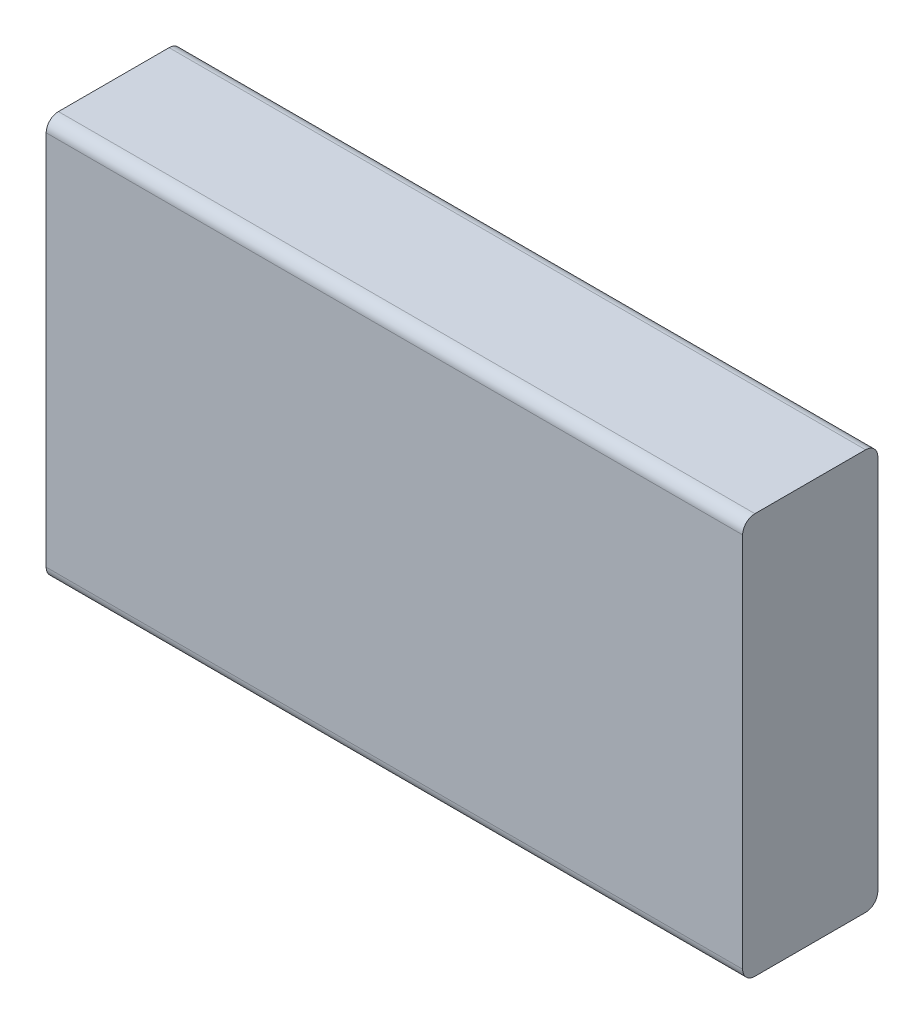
from build123d import *

# Parameters (mm, degrees)
SKETCH1_W           = 144.272
SKETCH1_H           = 83
BOSS_EXTRUDE1_DEPTH = 28
SKETCH2_R           = 1.501897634
SKETCH2_W           = 7.62
SKETCH2_H           = 2.54
CUT_EXTRUDE1_DEPTH  = 85.09
FILLET1_R           = 2.54


with BuildPart() as part:
    # Sketch1 → Boss-Extrude1 (new body)
    with BuildSketch(Plane.XY):
        with Locations((72.136, -41.5)):
            Rectangle(SKETCH1_W, SKETCH1_H)
    extrude(amount=BOSS_EXTRUDE1_DEPTH)

    # Sketch2 → Cut-Extrude1 (cut)
    with BuildSketch(Plane.ZY):
        with Locations(Location((14.170952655, -59.813461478, 0), (0, 0, 270))):
            Circle(SKETCH2_R)
        with Locations((14, -12.698053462)):
            Rectangle(SKETCH2_W, SKETCH2_H)
    extrude(amount=-CUT_EXTRUDE1_DEPTH, mode=Mode.SUBTRACT)

    # Fillet1
    fillet1_edges = [part.edges().sort_by_distance(p)[0] for p in [
        (72.136, 0, 28),
        (72.136, 0, 0),
        (72.136, -83, 0),
        (72.136, -83, 28),
    ]]
    fillet(fillet1_edges, radius=FILLET1_R)


solid = part.part
